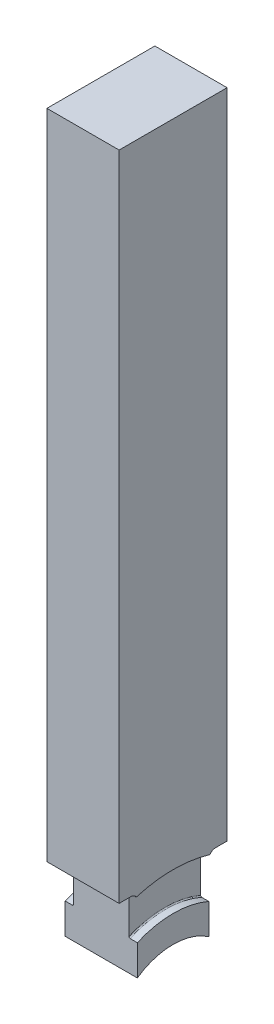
from build123d import *

# Parameters (mm, degrees)
SKETCH1_W               = 38.354
SKETCH1_H               = 276.225
BOSS_EXTRUDE1_DEPTH     = 12.827
CUT_EXTRUDE4_DEPTH      = 278.186832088
CUT_EXTRUDE4_DEPTH_BACK = 278.186832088
SKETCH8_R               = 22.225
SKETCH2_W               = 2.9718
SKETCH2_H               = 13.4874
CUT_EXTRUDE2_DEPTH      = 278.186832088
CUT_EXTRUDE2_DEPTH_BACK = 278.186832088
FILLET1_R               = 0.762
FILLET2_R               = 0.381


with BuildPart() as part:
    # Sketch1 → Boss-Extrude1 (new, symmetric)
    with BuildSketch(Plane(origin=(0, 0, 0), x_dir=(0, 0, -1), z_dir=(1, 0, 0))):
        with Locations((0, 138.1125)):
            Rectangle(SKETCH1_W, SKETCH1_H)
    extrude(amount=BOSS_EXTRUDE1_DEPTH, both=True)

    # Sketch8 → Cut-Extrude4 (cut, two sides: drawn at the far end of the back side and taken through both)
    with BuildSketch(Plane(origin=(0, 0, 0), x_dir=(0, 0, -1), z_dir=(1, 0, 0)).offset(-CUT_EXTRUDE4_DEPTH_BACK)):
        Circle(SKETCH8_R)
    extrude(amount=CUT_EXTRUDE4_DEPTH + CUT_EXTRUDE4_DEPTH_BACK, mode=Mode.SUBTRACT)

    # Sketch2 → Cut-Revolve1 (revolve, cut)
    with BuildSketch(Plane.XY):
        with Locations((11.3411, 38.4937)):
            Rectangle(SKETCH2_W, SKETCH2_H)
        with Locations((-11.3411, 38.4937)):
            Rectangle(SKETCH2_W, SKETCH2_H)
    revolve(axis=Axis((-8.84822894, 0, 0), (1, 0, 0)), mode=Mode.SUBTRACT)

    # Sketch6 → Cut-Extrude2 (cut, two sides: drawn at the far end of the back side and taken through both)
    with BuildSketch(Plane(origin=(0, 0, 0), x_dir=(0, 0, -1), z_dir=(1, 0, 0)).offset(-CUT_EXTRUDE2_DEPTH_BACK)):
        with BuildLine():
            Line((12.7, 0), (31.75, 0))
            Line((31.75, 0), (31.75, 44.4246))
            Line((31.75, 44.4246), (15.0876, 44.4246))
            ThreePointArc((15.0876, 44.4246), (13.399311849, 43.725288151), (12.7, 42.037))
            Line((12.7, 42.037), (12.7, 0))
        make_face()
        with BuildLine():
            Line((-12.7, 0), (-31.75, 0))
            Line((-31.75, 0), (-31.75, 44.4246))
            Line((-31.75, 44.4246), (-15.0876, 44.4246))
            ThreePointArc((-15.0876, 44.4246), (-13.399311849, 43.725288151), (-12.7, 42.037))
            Line((-12.7, 42.037), (-12.7, 0))
        make_face()
    extrude(amount=CUT_EXTRUDE2_DEPTH + CUT_EXTRUDE2_DEPTH_BACK, mode=Mode.SUBTRACT)

    # Fillet1
    fillet1_edges = [part.edges().sort_by_distance(p)[0] for p in [
        (9.8552, 45.2374, 0),
        (-9.8552, 45.2374, 0),
    ]]
    fillet(fillet1_edges, radius=FILLET1_R)

    # Fillet2
    fillet2_edges = [part.edges().sort_by_distance(p)[0] for p in [
        (9.8552, 31.75, 0),
        (-9.8552, 31.75, 0),
    ]]
    fillet(fillet2_edges, radius=FILLET2_R)


solid = part.part
